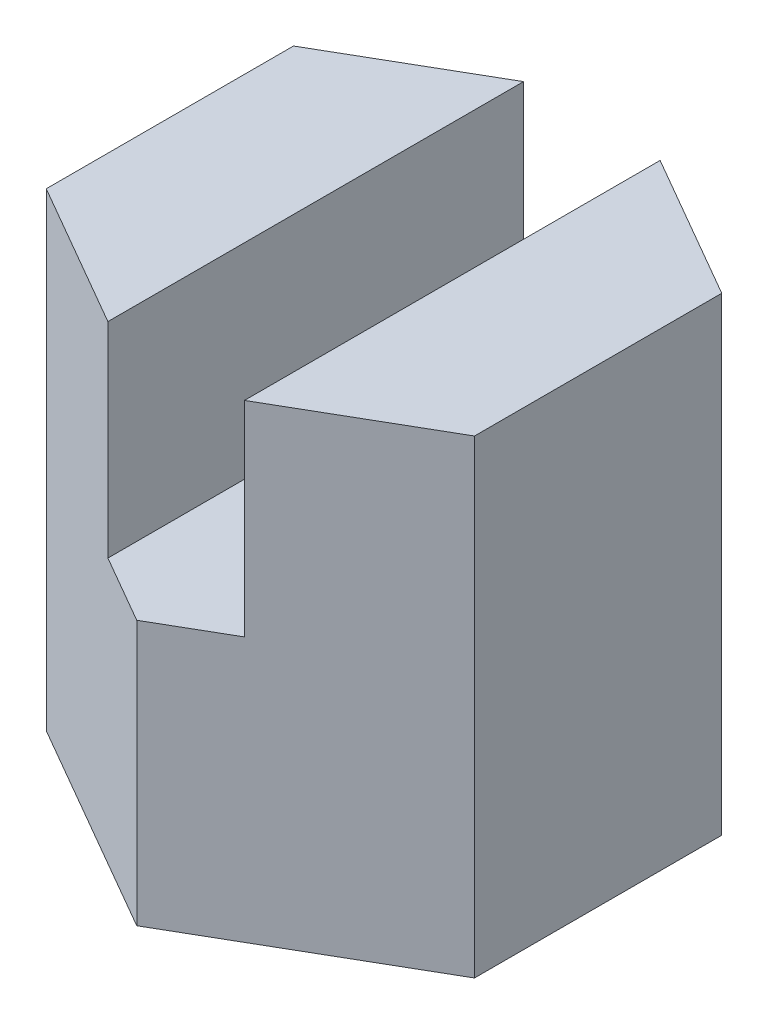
ISO-10303-21;
HEADER;
FILE_DESCRIPTION(('STEP AP214'),'2;1');
FILE_NAME('part.step','',(''),(''),'','','');
FILE_SCHEMA(('AUTOMOTIVE_DESIGN { 1 0 10303 214 1 1 1 1 }'));
ENDSEC;
DATA;
#1=APPLICATION_CONTEXT('core data for automotive mechanical design processes');
#2=APPLICATION_PROTOCOL_DEFINITION('international standard','automotive_design',2000,#1);
#3=PRODUCT_CONTEXT('',#1,'mechanical');
#4=PRODUCT('Part','Part','',(#3));
#5=PRODUCT_RELATED_PRODUCT_CATEGORY('part','',(#4));
#6=PRODUCT_DEFINITION_FORMATION('','',#4);
#7=PRODUCT_DEFINITION_CONTEXT('part definition',#1,'design');
#8=PRODUCT_DEFINITION('design','',#6,#7);
#9=PRODUCT_DEFINITION_SHAPE('','',#8);
#10=(LENGTH_UNIT() NAMED_UNIT(*) SI_UNIT(.MILLI.,.METRE.));
#11=(NAMED_UNIT(*) PLANE_ANGLE_UNIT() SI_UNIT($,.RADIAN.));
#12=(NAMED_UNIT(*) SI_UNIT($,.STERADIAN.) SOLID_ANGLE_UNIT());
#13=UNCERTAINTY_MEASURE_WITH_UNIT(LENGTH_MEASURE(1.E-05),#10,'distance_accuracy_value','');
#14=(GEOMETRIC_REPRESENTATION_CONTEXT(3) GLOBAL_UNCERTAINTY_ASSIGNED_CONTEXT((#13)) GLOBAL_UNIT_ASSIGNED_CONTEXT((#10,
#11,#12)) REPRESENTATION_CONTEXT('',''));
#15=CARTESIAN_POINT('',(0.,0.,0.));
#16=DIRECTION('',(0.,0.,1.));
#17=DIRECTION('',(1.,0.,0.));
#18=AXIS2_PLACEMENT_3D('',#15,#16,#17);
#19=CARTESIAN_POINT('',(50.1796313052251,110.,-28.9712236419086));
#20=DIRECTION('',(-0.499999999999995,0.,0.866025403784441));
#21=DIRECTION('',(0.866025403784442,0.,0.499999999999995));
#22=AXIS2_PLACEMENT_3D('',#19,#20,#21);
#23=PLANE('',#22);
#24=DIRECTION('',(0.,-1.,0.));
#25=VECTOR('',#24,1.);
#26=CARTESIAN_POINT('',(15.9999999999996,109.999999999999,-48.7048429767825));
#27=LINE('',#26,#25);
#28=CARTESIAN_POINT('',(15.9999999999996,110.,-48.7048429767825));
#29=VERTEX_POINT('',#28);
#30=CARTESIAN_POINT('',(16.0000000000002,62.0000000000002,-48.7048429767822));
#31=VERTEX_POINT('',#30);
#32=EDGE_CURVE('E127',#29,#31,#27,.T.);
#33=ORIENTED_EDGE('',*,*,#32,.F.);
#34=DIRECTION('',(-0.866025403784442,0.,-0.499999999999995));
#35=VECTOR('',#34,1.);
#36=CARTESIAN_POINT('',(50.1796313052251,110.,-28.9712236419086));
#37=LINE('',#36,#35);
#38=CARTESIAN_POINT('',(50.1796313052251,110.,-28.9712236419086));
#39=VERTEX_POINT('',#38);
#40=EDGE_CURVE('E160',#39,#29,#37,.T.);
#41=ORIENTED_EDGE('',*,*,#40,.F.);
#42=DIRECTION('',(0.,-1.,0.));
#43=VECTOR('',#42,1.);
#44=CARTESIAN_POINT('',(50.1796313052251,110.,-28.9712236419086));
#45=LINE('',#44,#43);
#46=CARTESIAN_POINT('',(50.1796313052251,0.,-28.9712236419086));
#47=VERTEX_POINT('',#46);
#48=EDGE_CURVE('E146',#39,#47,#45,.T.);
#49=ORIENTED_EDGE('',*,*,#48,.T.);
#50=DIRECTION('',(-0.866025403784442,0.,-0.499999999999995));
#51=VECTOR('',#50,1.);
#52=CARTESIAN_POINT('',(50.1796313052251,0.,-28.9712236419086));
#53=LINE('',#52,#51);
#54=CARTESIAN_POINT('',(0.,0.,-57.9424472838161));
#55=VERTEX_POINT('',#54);
#56=EDGE_CURVE('E171',#47,#55,#53,.T.);
#57=ORIENTED_EDGE('',*,*,#56,.T.);
#58=DIRECTION('',(0.,-1.,0.));
#59=VECTOR('',#58,1.);
#60=CARTESIAN_POINT('',(0.,110.,-57.9424472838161));
#61=LINE('',#60,#59);
#62=CARTESIAN_POINT('',(0.,62.0000000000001,-57.9424472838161));
#63=VERTEX_POINT('',#62);
#64=EDGE_CURVE('E152',#63,#55,#61,.T.);
#65=ORIENTED_EDGE('',*,*,#64,.F.);
#66=DIRECTION('',(0.866025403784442,0.,0.499999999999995));
#67=VECTOR('',#66,1.);
#68=CARTESIAN_POINT('',(50.1796313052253,62.0000000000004,-28.9712236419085));
#69=LINE('',#68,#67);
#70=EDGE_CURVE('E175',#63,#31,#69,.T.);
#71=ORIENTED_EDGE('',*,*,#70,.T.);
#72=EDGE_LOOP('',(#33,#41,#49,#57,#65,#71));
#73=FACE_BOUND('',#72,.T.);
#74=ADVANCED_FACE('F31',(#73),#23,.F.);
#75=CARTESIAN_POINT('',(4.04610181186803E-13,110.,57.9424472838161));
#76=DIRECTION('',(-0.500000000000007,0.,-0.866025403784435));
#77=DIRECTION('',(-0.866025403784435,0.,0.500000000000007));
#78=AXIS2_PLACEMENT_3D('',#75,#76,#77);
#79=PLANE('',#78);
#80=DIRECTION('',(0.,1.,0.));
#81=VECTOR('',#80,1.);
#82=CARTESIAN_POINT('',(15.9999999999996,110.,48.7048429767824));
#83=LINE('',#82,#81);
#84=CARTESIAN_POINT('',(16.0000000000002,62.0000000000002,48.7048429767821));
#85=VERTEX_POINT('',#84);
#86=CARTESIAN_POINT('',(15.9999999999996,110.,48.7048429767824));
#87=VERTEX_POINT('',#86);
#88=EDGE_CURVE('E135',#85,#87,#83,.T.);
#89=ORIENTED_EDGE('',*,*,#88,.F.);
#90=DIRECTION('',(-0.866025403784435,0.,0.500000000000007));
#91=VECTOR('',#90,1.);
#92=CARTESIAN_POINT('',(6.07572827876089E-13,62.0000000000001,57.942447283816));
#93=LINE('',#92,#91);
#94=CARTESIAN_POINT('',(4.05925293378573E-13,62.0000000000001,57.9424472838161));
#95=VERTEX_POINT('',#94);
#96=EDGE_CURVE('E11',#85,#95,#93,.T.);
#97=ORIENTED_EDGE('',*,*,#96,.T.);
#98=DIRECTION('',(0.,-1.,0.));
#99=VECTOR('',#98,1.);
#100=CARTESIAN_POINT('',(4.04610181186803E-13,110.,57.9424472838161));
#101=LINE('',#100,#99);
#102=CARTESIAN_POINT('',(4.04610181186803E-13,0.,57.9424472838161));
#103=VERTEX_POINT('',#102);
#104=EDGE_CURVE('E132',#95,#103,#101,.T.);
#105=ORIENTED_EDGE('',*,*,#104,.T.);
#106=DIRECTION('',(0.866025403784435,0.,-0.500000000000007));
#107=VECTOR('',#106,1.);
#108=CARTESIAN_POINT('',(4.04610181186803E-13,0.,57.9424472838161));
#109=LINE('',#108,#107);
#110=CARTESIAN_POINT('',(50.1796313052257,0.,28.9712236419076));
#111=VERTEX_POINT('',#110);
#112=EDGE_CURVE('E180',#103,#111,#109,.T.);
#113=ORIENTED_EDGE('',*,*,#112,.T.);
#114=DIRECTION('',(0.,-1.,0.));
#115=VECTOR('',#114,1.);
#116=CARTESIAN_POINT('',(50.1796313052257,110.,28.9712236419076));
#117=LINE('',#116,#115);
#118=CARTESIAN_POINT('',(50.1796313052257,110.,28.9712236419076));
#119=VERTEX_POINT('',#118);
#120=EDGE_CURVE('E142',#119,#111,#117,.T.);
#121=ORIENTED_EDGE('',*,*,#120,.F.);
#122=DIRECTION('',(0.866025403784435,0.,-0.500000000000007));
#123=VECTOR('',#122,1.);
#124=CARTESIAN_POINT('',(4.04610181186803E-13,110.,57.9424472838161));
#125=LINE('',#124,#123);
#126=EDGE_CURVE('E157',#87,#119,#125,.T.);
#127=ORIENTED_EDGE('',*,*,#126,.F.);
#128=EDGE_LOOP('',(#89,#97,#105,#113,#121,#127));
#129=FACE_BOUND('',#128,.T.);
#130=ADVANCED_FACE('F131',(#129),#79,.F.);
#131=CARTESIAN_POINT('',(0.,110.,-57.9424472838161));
#132=DIRECTION('',(0.,1.,0.));
#133=DIRECTION('',(0.,0.,1.));
#134=AXIS2_PLACEMENT_3D('',#131,#132,#133);
#135=PLANE('',#134);
#136=ORIENTED_EDGE('',*,*,#40,.T.);
#137=DIRECTION('',(0.,0.,1.));
#138=VECTOR('',#137,1.);
#139=CARTESIAN_POINT('',(15.9999999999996,110.,-57.9424472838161));
#140=LINE('',#139,#138);
#141=EDGE_CURVE('E38',#29,#87,#140,.T.);
#142=ORIENTED_EDGE('',*,*,#141,.T.);
#143=ORIENTED_EDGE('',*,*,#126,.T.);
#144=DIRECTION('',(0.,0.,-1.));
#145=VECTOR('',#144,1.);
#146=CARTESIAN_POINT('',(50.1796313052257,110.,28.9712236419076));
#147=LINE('',#146,#145);
#148=EDGE_CURVE('E54',#119,#39,#147,.T.);
#149=ORIENTED_EDGE('',*,*,#148,.T.);
#150=EDGE_LOOP('',(#136,#142,#143,#149));
#151=FACE_BOUND('',#150,.T.);
#152=ADVANCED_FACE('F156',(#151),#135,.T.);
#153=CARTESIAN_POINT('',(0.,110.,-57.9424472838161));
#154=DIRECTION('',(0.500000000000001,0.,0.866025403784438));
#155=DIRECTION('',(0.866025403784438,0.,-0.500000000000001));
#156=AXIS2_PLACEMENT_3D('',#153,#154,#155);
#157=PLANE('',#156);
#158=DIRECTION('',(0.,-1.,0.));
#159=VECTOR('',#158,1.);
#160=CARTESIAN_POINT('',(-15.9999999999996,110.,-48.7048429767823));
#161=LINE('',#160,#159);
#162=CARTESIAN_POINT('',(-15.9999999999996,110.,-48.7048429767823));
#163=VERTEX_POINT('',#162);
#164=CARTESIAN_POINT('',(-15.9999999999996,62.,-48.7048429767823));
#165=VERTEX_POINT('',#164);
#166=EDGE_CURVE('E45',#163,#165,#161,.T.);
#167=ORIENTED_EDGE('',*,*,#166,.T.);
#168=DIRECTION('',(0.866025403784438,0.,-0.500000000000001));
#169=VECTOR('',#168,1.);
#170=CARTESIAN_POINT('',(2.02962646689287E-13,62.0000000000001,-57.9424472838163));
#171=LINE('',#170,#169);
#172=EDGE_CURVE('E126',#165,#63,#171,.T.);
#173=ORIENTED_EDGE('',*,*,#172,.T.);
#174=ORIENTED_EDGE('',*,*,#64,.T.);
#175=DIRECTION('',(-0.866025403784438,0.,0.500000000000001));
#176=VECTOR('',#175,1.);
#177=CARTESIAN_POINT('',(0.,0.,-57.9424472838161));
#178=LINE('',#177,#176);
#179=CARTESIAN_POINT('',(-50.1796313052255,0.,-28.9712236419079));
#180=VERTEX_POINT('',#179);
#181=EDGE_CURVE('E174',#55,#180,#178,.T.);
#182=ORIENTED_EDGE('',*,*,#181,.T.);
#183=DIRECTION('',(0.,-1.,0.));
#184=VECTOR('',#183,1.);
#185=CARTESIAN_POINT('',(-50.1796313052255,110.,-28.9712236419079));
#186=LINE('',#185,#184);
#187=CARTESIAN_POINT('',(-50.1796313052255,110.,-28.9712236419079));
#188=VERTEX_POINT('',#187);
#189=EDGE_CURVE('E144',#188,#180,#186,.T.);
#190=ORIENTED_EDGE('',*,*,#189,.F.);
#191=DIRECTION('',(-0.866025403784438,0.,0.500000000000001));
#192=VECTOR('',#191,1.);
#193=CARTESIAN_POINT('',(0.,110.,-57.9424472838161));
#194=LINE('',#193,#192);
#195=EDGE_CURVE('E88',#163,#188,#194,.T.);
#196=ORIENTED_EDGE('',*,*,#195,.F.);
#197=EDGE_LOOP('',(#167,#173,#174,#182,#190,#196));
#198=FACE_BOUND('',#197,.T.);
#199=ADVANCED_FACE('F190',(#198),#157,.F.);
#200=CARTESIAN_POINT('',(-50.1796313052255,110.,-28.9712236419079));
#201=DIRECTION('',(1.,0.,0.));
#202=DIRECTION('',(0.,0.,-1.));
#203=AXIS2_PLACEMENT_3D('',#200,#201,#202);
#204=PLANE('',#203);
#205=DIRECTION('',(0.,0.,1.));
#206=VECTOR('',#205,1.);
#207=CARTESIAN_POINT('',(-50.1796313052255,0.,-28.9712236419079));
#208=LINE('',#207,#206);
#209=CARTESIAN_POINT('',(-50.1796313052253,0.,28.9712236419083));
#210=VERTEX_POINT('',#209);
#211=EDGE_CURVE('E177',#180,#210,#208,.T.);
#212=ORIENTED_EDGE('',*,*,#211,.T.);
#213=DIRECTION('',(0.,-1.,0.));
#214=VECTOR('',#213,1.);
#215=CARTESIAN_POINT('',(-50.1796313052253,110.,28.9712236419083));
#216=LINE('',#215,#214);
#217=CARTESIAN_POINT('',(-50.1796313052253,110.,28.9712236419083));
#218=VERTEX_POINT('',#217);
#219=EDGE_CURVE('E141',#218,#210,#216,.T.);
#220=ORIENTED_EDGE('',*,*,#219,.F.);
#221=DIRECTION('',(0.,0.,1.));
#222=VECTOR('',#221,1.);
#223=CARTESIAN_POINT('',(-50.1796313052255,110.,-28.9712236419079));
#224=LINE('',#223,#222);
#225=EDGE_CURVE('E167',#188,#218,#224,.T.);
#226=ORIENTED_EDGE('',*,*,#225,.F.);
#227=ORIENTED_EDGE('',*,*,#189,.T.);
#228=EDGE_LOOP('',(#212,#220,#226,#227));
#229=FACE_BOUND('',#228,.T.);
#230=ADVANCED_FACE('F194',(#229),#204,.F.);
#231=CARTESIAN_POINT('',(-50.1796313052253,110.,28.9712236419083));
#232=DIRECTION('',(0.499999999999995,0.,-0.866025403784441));
#233=DIRECTION('',(-0.866025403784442,0.,-0.499999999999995));
#234=AXIS2_PLACEMENT_3D('',#231,#232,#233);
#235=PLANE('',#234);
#236=ORIENTED_EDGE('',*,*,#104,.F.);
#237=DIRECTION('',(-0.866025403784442,0.,-0.499999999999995));
#238=VECTOR('',#237,1.);
#239=CARTESIAN_POINT('',(-50.1796313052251,61.9999999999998,28.9712236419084));
#240=LINE('',#239,#238);
#241=CARTESIAN_POINT('',(-15.9999999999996,62.,48.7048429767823));
#242=VERTEX_POINT('',#241);
#243=EDGE_CURVE('E118',#95,#242,#240,.T.);
#244=ORIENTED_EDGE('',*,*,#243,.T.);
#245=DIRECTION('',(0.,1.,0.));
#246=VECTOR('',#245,1.);
#247=CARTESIAN_POINT('',(-15.9999999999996,110.,48.7048429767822));
#248=LINE('',#247,#246);
#249=CARTESIAN_POINT('',(-15.9999999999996,110.,48.7048429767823));
#250=VERTEX_POINT('',#249);
#251=EDGE_CURVE('E206',#242,#250,#248,.T.);
#252=ORIENTED_EDGE('',*,*,#251,.T.);
#253=DIRECTION('',(0.866025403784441,0.,0.499999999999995));
#254=VECTOR('',#253,1.);
#255=CARTESIAN_POINT('',(-50.1796313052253,110.,28.9712236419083));
#256=LINE('',#255,#254);
#257=EDGE_CURVE('E163',#218,#250,#256,.T.);
#258=ORIENTED_EDGE('',*,*,#257,.F.);
#259=ORIENTED_EDGE('',*,*,#219,.T.);
#260=DIRECTION('',(0.866025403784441,0.,0.499999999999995));
#261=VECTOR('',#260,1.);
#262=CARTESIAN_POINT('',(-50.1796313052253,0.,28.9712236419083));
#263=LINE('',#262,#261);
#264=EDGE_CURVE('E139',#210,#103,#263,.T.);
#265=ORIENTED_EDGE('',*,*,#264,.T.);
#266=EDGE_LOOP('',(#236,#244,#252,#258,#259,#265));
#267=FACE_BOUND('',#266,.T.);
#268=ADVANCED_FACE('F136',(#267),#235,.F.);
#269=CARTESIAN_POINT('',(50.1796313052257,110.,28.9712236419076));
#270=DIRECTION('',(-1.,0.,0.));
#271=DIRECTION('',(0.,0.,1.));
#272=AXIS2_PLACEMENT_3D('',#269,#270,#271);
#273=PLANE('',#272);
#274=DIRECTION('',(0.,0.,-1.));
#275=VECTOR('',#274,1.);
#276=CARTESIAN_POINT('',(50.1796313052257,0.,28.9712236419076));
#277=LINE('',#276,#275);
#278=EDGE_CURVE('E81',#111,#47,#277,.T.);
#279=ORIENTED_EDGE('',*,*,#278,.T.);
#280=ORIENTED_EDGE('',*,*,#48,.F.);
#281=ORIENTED_EDGE('',*,*,#148,.F.);
#282=ORIENTED_EDGE('',*,*,#120,.T.);
#283=EDGE_LOOP('',(#279,#280,#281,#282));
#284=FACE_BOUND('',#283,.T.);
#285=ADVANCED_FACE('F214',(#284),#273,.F.);
#286=DIRECTION('',(0.,0.,1.));
#287=VECTOR('',#286,1.);
#288=CARTESIAN_POINT('',(-15.9999999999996,110.,-57.9424472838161));
#289=LINE('',#288,#287);
#290=EDGE_CURVE('E154',#163,#250,#289,.T.);
#291=ORIENTED_EDGE('',*,*,#290,.F.);
#292=ORIENTED_EDGE('',*,*,#195,.T.);
#293=ORIENTED_EDGE('',*,*,#225,.T.);
#294=ORIENTED_EDGE('',*,*,#257,.T.);
#295=EDGE_LOOP('',(#291,#292,#293,#294));
#296=FACE_BOUND('',#295,.T.);
#297=ADVANCED_FACE('F212',(#296),#135,.T.);
#298=CARTESIAN_POINT('',(0.,0.,-57.9424472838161));
#299=DIRECTION('',(0.,1.,0.));
#300=DIRECTION('',(0.,0.,1.));
#301=AXIS2_PLACEMENT_3D('',#298,#299,#300);
#302=PLANE('',#301);
#303=ORIENTED_EDGE('',*,*,#56,.F.);
#304=ORIENTED_EDGE('',*,*,#278,.F.);
#305=ORIENTED_EDGE('',*,*,#112,.F.);
#306=ORIENTED_EDGE('',*,*,#264,.F.);
#307=ORIENTED_EDGE('',*,*,#211,.F.);
#308=ORIENTED_EDGE('',*,*,#181,.F.);
#309=EDGE_LOOP('',(#303,#304,#305,#306,#307,#308));
#310=FACE_BOUND('',#309,.T.);
#311=ADVANCED_FACE('F187',(#310),#302,.F.);
#312=CARTESIAN_POINT('',(-15.9999999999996,62.,-57.9424472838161));
#313=DIRECTION('',(0.,-1.,0.));
#314=DIRECTION('',(1.,0.,0.));
#315=AXIS2_PLACEMENT_3D('',#312,#313,#314);
#316=PLANE('',#315);
#317=ORIENTED_EDGE('',*,*,#172,.F.);
#318=DIRECTION('',(0.,0.,1.));
#319=VECTOR('',#318,1.);
#320=CARTESIAN_POINT('',(-15.9999999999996,62.,-57.9424472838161));
#321=LINE('',#320,#319);
#322=EDGE_CURVE('E122',#165,#242,#321,.T.);
#323=ORIENTED_EDGE('',*,*,#322,.T.);
#324=ORIENTED_EDGE('',*,*,#243,.F.);
#325=ORIENTED_EDGE('',*,*,#96,.F.);
#326=DIRECTION('',(0.,0.,1.));
#327=VECTOR('',#326,1.);
#328=CARTESIAN_POINT('',(16.0000000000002,62.0000000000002,-57.9424472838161));
#329=LINE('',#328,#327);
#330=EDGE_CURVE('E208',#31,#85,#329,.T.);
#331=ORIENTED_EDGE('',*,*,#330,.F.);
#332=ORIENTED_EDGE('',*,*,#70,.F.);
#333=EDGE_LOOP('',(#317,#323,#324,#325,#331,#332));
#334=FACE_BOUND('',#333,.T.);
#335=ADVANCED_FACE('F119',(#334),#316,.F.);
#336=CARTESIAN_POINT('',(15.9999999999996,110.,-57.9424472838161));
#337=DIRECTION('',(-1.,0.,0.));
#338=DIRECTION('',(0.,-1.,0.));
#339=AXIS2_PLACEMENT_3D('',#336,#337,#338);
#340=PLANE('',#339);
#341=ORIENTED_EDGE('',*,*,#32,.T.);
#342=ORIENTED_EDGE('',*,*,#330,.T.);
#343=ORIENTED_EDGE('',*,*,#88,.T.);
#344=ORIENTED_EDGE('',*,*,#141,.F.);
#345=EDGE_LOOP('',(#341,#342,#343,#344));
#346=FACE_BOUND('',#345,.T.);
#347=ADVANCED_FACE('F210',(#346),#340,.T.);
#348=CARTESIAN_POINT('',(-15.9999999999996,110.,-57.9424472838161));
#349=DIRECTION('',(-1.,0.,0.));
#350=DIRECTION('',(0.,-1.,0.));
#351=AXIS2_PLACEMENT_3D('',#348,#349,#350);
#352=PLANE('',#351);
#353=ORIENTED_EDGE('',*,*,#290,.T.);
#354=ORIENTED_EDGE('',*,*,#251,.F.);
#355=ORIENTED_EDGE('',*,*,#322,.F.);
#356=ORIENTED_EDGE('',*,*,#166,.F.);
#357=EDGE_LOOP('',(#353,#354,#355,#356));
#358=FACE_BOUND('',#357,.T.);
#359=ADVANCED_FACE('F211',(#358),#352,.F.);
#360=CLOSED_SHELL('',(#74,#130,#152,#199,#230,#268,#285,#297,#311,#335,#347,#359));
#361=MANIFOLD_SOLID_BREP('B2',#360);
#362=ADVANCED_BREP_SHAPE_REPRESENTATION('',(#18,#361),#14);
#363=SHAPE_DEFINITION_REPRESENTATION(#9,#362);
ENDSEC;
END-ISO-10303-21;
